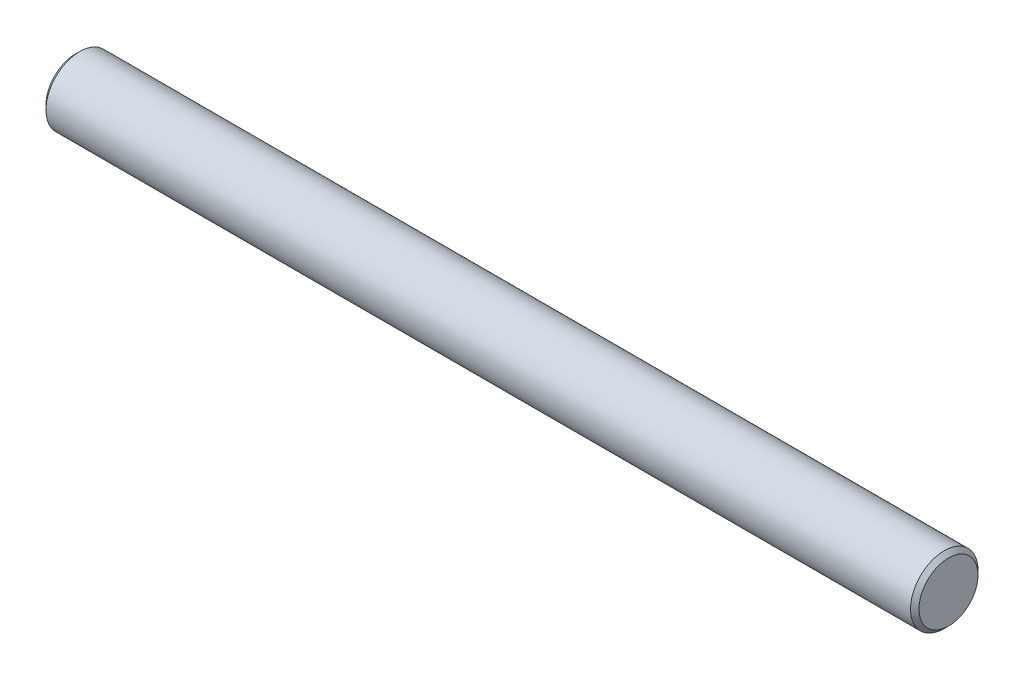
from build123d import *

# Parameters (mm, degrees)
SKETCH1_R      = 8
EXTRUDE1_DEPTH = 207
CHAMFER1_SIZE  = 1


with BuildPart() as part:
    # Sketch1 → Extrude1 (new body)
    with BuildSketch(Plane(origin=(0, 0, 0), x_dir=(0, 0, -1), z_dir=(1, 0, 0))):
        Circle(SKETCH1_R)
    extrude(amount=EXTRUDE1_DEPTH)

    # Chamfer1
    chamfer1_edges = [part.edges().sort_by_distance(p)[0] for p in [
        (0, 0, 8),
        (207, 0, 8),
    ]]
    chamfer(chamfer1_edges, length=CHAMFER1_SIZE)


solid = part.part
